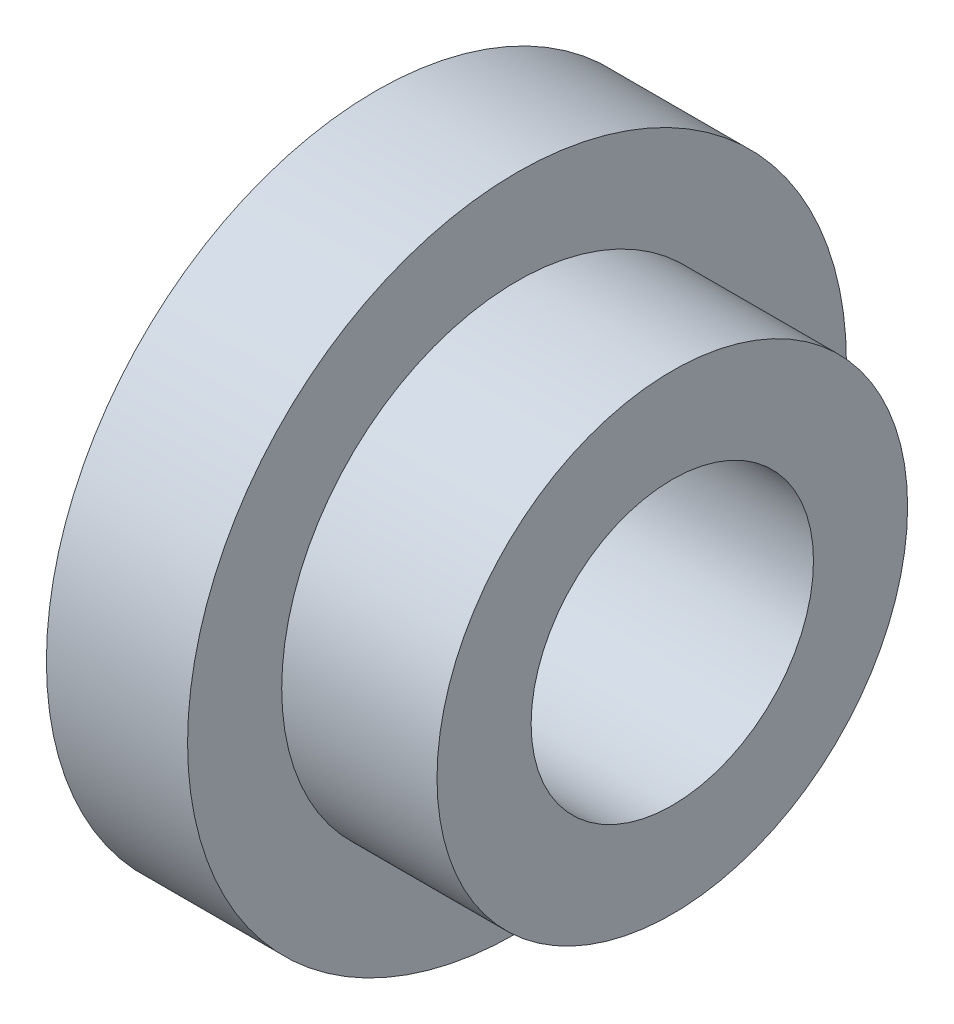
from build123d import *

# Parameters (mm, degrees)
SKETCH2_R          = 3
CUT_EXTRUDE1_DEPTH = 12.73413823


with BuildPart() as part:
    # Sketch1 → Revolve1 (revolve)
    with BuildSketch(Plane(origin=(0, 0, 0), x_dir=(1, 0, 0), z_dir=(0, 1, 0)), mode=Mode.PRIVATE) as revolve1_sk:
        Polygon((0, 0), (6.3, 0), (6.3, 5), (3, 5), (3, 7), (0, 7), align=None)
    revolve(revolve1_sk.sketch.rotate(Axis((0, 0, 0), (1, 0, 0)), 180), axis=Axis((0, 0, 0), (1, 0, 0)))

    # Sketch2 → Cut-Extrude1 (cut, through all)
    with BuildSketch(Plane(origin=(6.3, 0, 0), x_dir=(0, 0, -1), z_dir=(1, 0, 0))):
        Circle(SKETCH2_R)
    extrude(amount=-CUT_EXTRUDE1_DEPTH, mode=Mode.SUBTRACT)


solid = part.part
